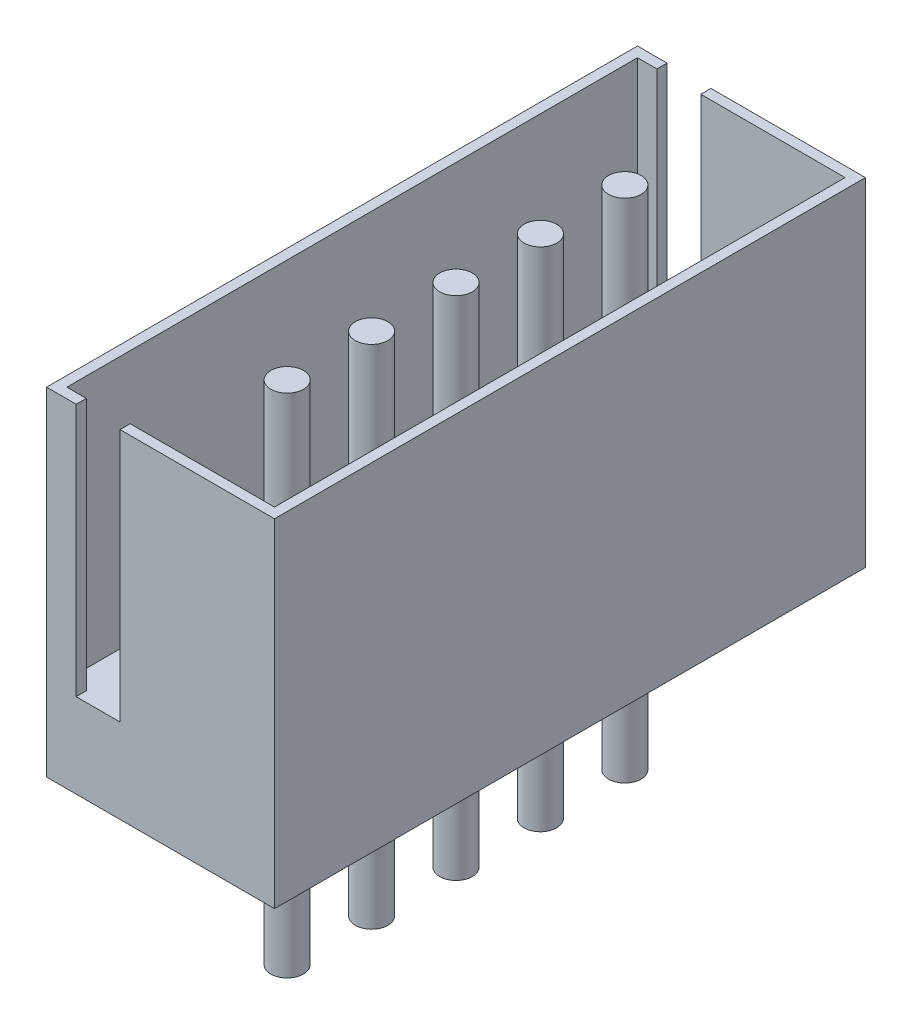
ISO-10303-21;
HEADER;
FILE_DESCRIPTION(('STEP AP214'),'2;1');
FILE_NAME('part.step','',(''),(''),'','','');
FILE_SCHEMA(('AUTOMOTIVE_DESIGN { 1 0 10303 214 1 1 1 1 }'));
ENDSEC;
DATA;
#1=APPLICATION_CONTEXT('core data for automotive mechanical design processes');
#2=APPLICATION_PROTOCOL_DEFINITION('international standard','automotive_design',2000,#1);
#3=PRODUCT_CONTEXT('',#1,'mechanical');
#4=PRODUCT('Part','Part','',(#3));
#5=PRODUCT_RELATED_PRODUCT_CATEGORY('part','',(#4));
#6=PRODUCT_DEFINITION_FORMATION('','',#4);
#7=PRODUCT_DEFINITION_CONTEXT('part definition',#1,'design');
#8=PRODUCT_DEFINITION('design','',#6,#7);
#9=PRODUCT_DEFINITION_SHAPE('','',#8);
#10=(LENGTH_UNIT() NAMED_UNIT(*) SI_UNIT(.MILLI.,.METRE.));
#11=(NAMED_UNIT(*) PLANE_ANGLE_UNIT() SI_UNIT($,.RADIAN.));
#12=(NAMED_UNIT(*) SI_UNIT($,.STERADIAN.) SOLID_ANGLE_UNIT());
#13=UNCERTAINTY_MEASURE_WITH_UNIT(LENGTH_MEASURE(1.E-05),#10,'distance_accuracy_value','');
#14=(GEOMETRIC_REPRESENTATION_CONTEXT(3) GLOBAL_UNCERTAINTY_ASSIGNED_CONTEXT((#13)) GLOBAL_UNIT_ASSIGNED_CONTEXT((#10,
#11,#12)) REPRESENTATION_CONTEXT('',''));
#15=CARTESIAN_POINT('',(0.,0.,0.));
#16=DIRECTION('',(0.,0.,1.));
#17=DIRECTION('',(1.,0.,0.));
#18=AXIS2_PLACEMENT_3D('',#15,#16,#17);
#19=CARTESIAN_POINT('',(9.15044707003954,6.604,-18.4394884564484));
#20=DIRECTION('',(0.,1.,0.));
#21=DIRECTION('',(0.,0.,-1.));
#22=AXIS2_PLACEMENT_3D('',#19,#20,#21);
#23=PLANE('',#22);
#24=CARTESIAN_POINT('',(8.89,6.60399999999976,-22.606));
#25=DIRECTION('',(0.,1.,0.));
#26=DIRECTION('',(0.,0.,1.));
#27=AXIS2_PLACEMENT_3D('',#24,#25,#26);
#28=CIRCLE('',#27,0.245107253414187);
#29=CARTESIAN_POINT('',(8.89,6.60399999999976,-22.3608927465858));
#30=VERTEX_POINT('',#29);
#31=EDGE_CURVE('E20',#30,#30,#28,.T.);
#32=ORIENTED_EDGE('',*,*,#31,.T.);
#33=EDGE_LOOP('',(#32));
#34=FACE_BOUND('',#33,.T.);
#35=ADVANCED_FACE('F16',(#34),#23,.T.);
#36=CARTESIAN_POINT('',(9.15044707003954,6.604,-18.4394884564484));
#37=DIRECTION('',(0.,1.,0.));
#38=DIRECTION('',(0.,0.,-1.));
#39=AXIS2_PLACEMENT_3D('',#36,#37,#38);
#40=PLANE('',#39);
#41=CARTESIAN_POINT('',(8.89,6.60399999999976,-23.876));
#42=DIRECTION('',(0.,1.,0.));
#43=DIRECTION('',(0.,0.,1.));
#44=AXIS2_PLACEMENT_3D('',#41,#42,#43);
#45=CIRCLE('',#44,0.245107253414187);
#46=CARTESIAN_POINT('',(8.89,6.60399999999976,-23.6308927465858));
#47=VERTEX_POINT('',#46);
#48=EDGE_CURVE('E220',#47,#47,#45,.T.);
#49=ORIENTED_EDGE('',*,*,#48,.T.);
#50=EDGE_LOOP('',(#49));
#51=FACE_BOUND('',#50,.T.);
#52=ADVANCED_FACE('F667',(#51),#40,.T.);
#53=CARTESIAN_POINT('',(9.15044707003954,6.604,-18.4394884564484));
#54=DIRECTION('',(0.,1.,0.));
#55=DIRECTION('',(0.,0.,-1.));
#56=AXIS2_PLACEMENT_3D('',#53,#54,#55);
#57=PLANE('',#56);
#58=CARTESIAN_POINT('',(8.89,6.60399999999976,-21.336));
#59=DIRECTION('',(0.,1.,0.));
#60=DIRECTION('',(0.,0.,1.));
#61=AXIS2_PLACEMENT_3D('',#58,#59,#60);
#62=CIRCLE('',#61,0.245107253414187);
#63=CARTESIAN_POINT('',(8.89,6.60399999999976,-21.0908927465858));
#64=VERTEX_POINT('',#63);
#65=EDGE_CURVE('E218',#64,#64,#62,.T.);
#66=ORIENTED_EDGE('',*,*,#65,.T.);
#67=EDGE_LOOP('',(#66));
#68=FACE_BOUND('',#67,.T.);
#69=ADVANCED_FACE('F670',(#68),#57,.T.);
#70=CARTESIAN_POINT('',(9.15044707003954,6.604,-18.4394884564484));
#71=DIRECTION('',(0.,1.,0.));
#72=DIRECTION('',(0.,0.,-1.));
#73=AXIS2_PLACEMENT_3D('',#70,#71,#72);
#74=PLANE('',#73);
#75=CARTESIAN_POINT('',(8.89,6.60399999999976,-20.066));
#76=DIRECTION('',(0.,1.,0.));
#77=DIRECTION('',(0.,0.,1.));
#78=AXIS2_PLACEMENT_3D('',#75,#76,#77);
#79=CIRCLE('',#78,0.24510725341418);
#80=CARTESIAN_POINT('',(8.89,6.60399999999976,-19.8208927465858));
#81=VERTEX_POINT('',#80);
#82=EDGE_CURVE('E215',#81,#81,#79,.T.);
#83=ORIENTED_EDGE('',*,*,#82,.T.);
#84=EDGE_LOOP('',(#83));
#85=FACE_BOUND('',#84,.T.);
#86=ADVANCED_FACE('F673',(#85),#74,.T.);
#87=CARTESIAN_POINT('',(9.15044707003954,6.604,-18.4394884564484));
#88=DIRECTION('',(0.,1.,0.));
#89=DIRECTION('',(0.,0.,-1.));
#90=AXIS2_PLACEMENT_3D('',#87,#88,#89);
#91=PLANE('',#90);
#92=CARTESIAN_POINT('',(8.89,6.60399999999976,-18.796));
#93=DIRECTION('',(0.,1.,0.));
#94=DIRECTION('',(0.,0.,1.));
#95=AXIS2_PLACEMENT_3D('',#92,#93,#94);
#96=CIRCLE('',#95,0.24510725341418);
#97=CARTESIAN_POINT('',(8.89,6.60399999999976,-18.5508927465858));
#98=VERTEX_POINT('',#97);
#99=EDGE_CURVE('E159',#98,#98,#96,.T.);
#100=ORIENTED_EDGE('',*,*,#99,.T.);
#101=EDGE_LOOP('',(#100));
#102=FACE_BOUND('',#101,.T.);
#103=ADVANCED_FACE('F232',(#102),#91,.T.);
#104=CARTESIAN_POINT('',(8.89,2.794,-22.606));
#105=DIRECTION('',(0.,1.,0.));
#106=DIRECTION('',(0.,0.,1.));
#107=AXIS2_PLACEMENT_3D('',#104,#105,#106);
#108=CYLINDRICAL_SURFACE('',#107,0.245107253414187);
#109=ORIENTED_EDGE('',*,*,#31,.F.);
#110=EDGE_LOOP('',(#109));
#111=FACE_BOUND('',#110,.T.);
#112=CARTESIAN_POINT('',(8.89,2.794,-22.606));
#113=DIRECTION('',(0.,1.,0.));
#114=DIRECTION('',(0.,0.,1.));
#115=AXIS2_PLACEMENT_3D('',#112,#113,#114);
#116=CIRCLE('',#115,0.245107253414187);
#117=CARTESIAN_POINT('',(8.89,2.794,-22.3608927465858));
#118=VERTEX_POINT('',#117);
#119=EDGE_CURVE('E210',#118,#118,#116,.F.);
#120=ORIENTED_EDGE('',*,*,#119,.F.);
#121=EDGE_LOOP('',(#120));
#122=FACE_BOUND('',#121,.T.);
#123=ADVANCED_FACE('F228',(#111,#122),#108,.T.);
#124=CARTESIAN_POINT('',(8.89,2.794,-23.876));
#125=DIRECTION('',(0.,1.,0.));
#126=DIRECTION('',(0.,0.,1.));
#127=AXIS2_PLACEMENT_3D('',#124,#125,#126);
#128=CYLINDRICAL_SURFACE('',#127,0.245107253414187);
#129=ORIENTED_EDGE('',*,*,#48,.F.);
#130=EDGE_LOOP('',(#129));
#131=FACE_BOUND('',#130,.T.);
#132=CARTESIAN_POINT('',(8.89,2.794,-23.876));
#133=DIRECTION('',(0.,1.,0.));
#134=DIRECTION('',(0.,0.,1.));
#135=AXIS2_PLACEMENT_3D('',#132,#133,#134);
#136=CIRCLE('',#135,0.245107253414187);
#137=CARTESIAN_POINT('',(8.89,2.794,-23.6308927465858));
#138=VERTEX_POINT('',#137);
#139=EDGE_CURVE('E207',#138,#138,#136,.F.);
#140=ORIENTED_EDGE('',*,*,#139,.F.);
#141=EDGE_LOOP('',(#140));
#142=FACE_BOUND('',#141,.T.);
#143=ADVANCED_FACE('F231',(#131,#142),#128,.T.);
#144=CARTESIAN_POINT('',(8.89,2.794,-21.336));
#145=DIRECTION('',(0.,1.,0.));
#146=DIRECTION('',(0.,0.,1.));
#147=AXIS2_PLACEMENT_3D('',#144,#145,#146);
#148=CYLINDRICAL_SURFACE('',#147,0.245107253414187);
#149=ORIENTED_EDGE('',*,*,#65,.F.);
#150=EDGE_LOOP('',(#149));
#151=FACE_BOUND('',#150,.T.);
#152=CARTESIAN_POINT('',(8.89,2.794,-21.336));
#153=DIRECTION('',(0.,1.,0.));
#154=DIRECTION('',(0.,0.,1.));
#155=AXIS2_PLACEMENT_3D('',#152,#153,#154);
#156=CIRCLE('',#155,0.245107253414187);
#157=CARTESIAN_POINT('',(8.89,2.794,-21.0908927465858));
#158=VERTEX_POINT('',#157);
#159=EDGE_CURVE('E204',#158,#158,#156,.F.);
#160=ORIENTED_EDGE('',*,*,#159,.F.);
#161=EDGE_LOOP('',(#160));
#162=FACE_BOUND('',#161,.T.);
#163=ADVANCED_FACE('F657',(#151,#162),#148,.T.);
#164=CARTESIAN_POINT('',(8.89,2.794,-20.066));
#165=DIRECTION('',(0.,1.,0.));
#166=DIRECTION('',(0.,0.,1.));
#167=AXIS2_PLACEMENT_3D('',#164,#165,#166);
#168=CYLINDRICAL_SURFACE('',#167,0.24510725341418);
#169=ORIENTED_EDGE('',*,*,#82,.F.);
#170=EDGE_LOOP('',(#169));
#171=FACE_BOUND('',#170,.T.);
#172=CARTESIAN_POINT('',(8.89,2.794,-20.066));
#173=DIRECTION('',(0.,1.,0.));
#174=DIRECTION('',(0.,0.,1.));
#175=AXIS2_PLACEMENT_3D('',#172,#173,#174);
#176=CIRCLE('',#175,0.24510725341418);
#177=CARTESIAN_POINT('',(8.89,2.794,-19.8208927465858));
#178=VERTEX_POINT('',#177);
#179=EDGE_CURVE('E201',#178,#178,#176,.F.);
#180=ORIENTED_EDGE('',*,*,#179,.F.);
#181=EDGE_LOOP('',(#180));
#182=FACE_BOUND('',#181,.T.);
#183=ADVANCED_FACE('F653',(#171,#182),#168,.T.);
#184=CARTESIAN_POINT('',(8.89,2.794,-18.796));
#185=DIRECTION('',(0.,1.,0.));
#186=DIRECTION('',(0.,0.,1.));
#187=AXIS2_PLACEMENT_3D('',#184,#185,#186);
#188=CYLINDRICAL_SURFACE('',#187,0.24510725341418);
#189=ORIENTED_EDGE('',*,*,#99,.F.);
#190=EDGE_LOOP('',(#189));
#191=FACE_BOUND('',#190,.T.);
#192=CARTESIAN_POINT('',(8.89,2.794,-18.796));
#193=DIRECTION('',(0.,1.,0.));
#194=DIRECTION('',(0.,0.,1.));
#195=AXIS2_PLACEMENT_3D('',#192,#193,#194);
#196=CIRCLE('',#195,0.24510725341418);
#197=CARTESIAN_POINT('',(8.89,2.794,-18.5508927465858));
#198=VERTEX_POINT('',#197);
#199=EDGE_CURVE('E197',#198,#198,#196,.F.);
#200=ORIENTED_EDGE('',*,*,#199,.F.);
#201=EDGE_LOOP('',(#200));
#202=FACE_BOUND('',#201,.T.);
#203=ADVANCED_FACE('F649',(#191,#202),#188,.T.);
#204=CARTESIAN_POINT('',(9.15044707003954,-1.016,-18.4394884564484));
#205=DIRECTION('',(0.,1.,0.));
#206=DIRECTION('',(0.,0.,-1.));
#207=AXIS2_PLACEMENT_3D('',#204,#205,#206);
#208=PLANE('',#207);
#209=CARTESIAN_POINT('',(8.89,-1.01599999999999,-22.606));
#210=DIRECTION('',(0.,1.,0.));
#211=DIRECTION('',(0.,0.,1.));
#212=AXIS2_PLACEMENT_3D('',#209,#210,#211);
#213=CIRCLE('',#212,0.245107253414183);
#214=CARTESIAN_POINT('',(8.89,-1.01599999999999,-22.3608927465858));
#215=VERTEX_POINT('',#214);
#216=EDGE_CURVE('E193',#215,#215,#213,.F.);
#217=ORIENTED_EDGE('',*,*,#216,.T.);
#218=EDGE_LOOP('',(#217));
#219=FACE_BOUND('',#218,.T.);
#220=ADVANCED_FACE('F652',(#219),#208,.F.);
#221=CARTESIAN_POINT('',(9.15044707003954,-1.016,-18.4394884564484));
#222=DIRECTION('',(0.,1.,0.));
#223=DIRECTION('',(0.,0.,-1.));
#224=AXIS2_PLACEMENT_3D('',#221,#222,#223);
#225=PLANE('',#224);
#226=CARTESIAN_POINT('',(8.89,-1.01599999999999,-23.876));
#227=DIRECTION('',(0.,1.,0.));
#228=DIRECTION('',(0.,0.,1.));
#229=AXIS2_PLACEMENT_3D('',#226,#227,#228);
#230=CIRCLE('',#229,0.245107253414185);
#231=CARTESIAN_POINT('',(8.89,-1.01599999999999,-23.6308927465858));
#232=VERTEX_POINT('',#231);
#233=EDGE_CURVE('E190',#232,#232,#230,.F.);
#234=ORIENTED_EDGE('',*,*,#233,.T.);
#235=EDGE_LOOP('',(#234));
#236=FACE_BOUND('',#235,.T.);
#237=ADVANCED_FACE('F683',(#236),#225,.F.);
#238=CARTESIAN_POINT('',(9.15044707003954,-1.016,-18.4394884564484));
#239=DIRECTION('',(0.,1.,0.));
#240=DIRECTION('',(0.,0.,-1.));
#241=AXIS2_PLACEMENT_3D('',#238,#239,#240);
#242=PLANE('',#241);
#243=CARTESIAN_POINT('',(8.89,-1.01599999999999,-21.336));
#244=DIRECTION('',(0.,1.,0.));
#245=DIRECTION('',(0.,0.,1.));
#246=AXIS2_PLACEMENT_3D('',#243,#244,#245);
#247=CIRCLE('',#246,0.245107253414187);
#248=CARTESIAN_POINT('',(8.89,-1.01599999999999,-21.0908927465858));
#249=VERTEX_POINT('',#248);
#250=EDGE_CURVE('E187',#249,#249,#247,.F.);
#251=ORIENTED_EDGE('',*,*,#250,.T.);
#252=EDGE_LOOP('',(#251));
#253=FACE_BOUND('',#252,.T.);
#254=ADVANCED_FACE('F687',(#253),#242,.F.);
#255=CARTESIAN_POINT('',(9.15044707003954,-1.016,-18.4394884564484));
#256=DIRECTION('',(0.,1.,0.));
#257=DIRECTION('',(0.,0.,-1.));
#258=AXIS2_PLACEMENT_3D('',#255,#256,#257);
#259=PLANE('',#258);
#260=CARTESIAN_POINT('',(8.89,-1.01599999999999,-20.066));
#261=DIRECTION('',(0.,1.,0.));
#262=DIRECTION('',(0.,0.,1.));
#263=AXIS2_PLACEMENT_3D('',#260,#261,#262);
#264=CIRCLE('',#263,0.24510725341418);
#265=CARTESIAN_POINT('',(8.89,-1.01599999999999,-19.8208927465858));
#266=VERTEX_POINT('',#265);
#267=EDGE_CURVE('E184',#266,#266,#264,.F.);
#268=ORIENTED_EDGE('',*,*,#267,.T.);
#269=EDGE_LOOP('',(#268));
#270=FACE_BOUND('',#269,.T.);
#271=ADVANCED_FACE('F249',(#270),#259,.F.);
#272=CARTESIAN_POINT('',(9.15044707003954,-1.016,-18.4394884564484));
#273=DIRECTION('',(0.,1.,0.));
#274=DIRECTION('',(0.,0.,-1.));
#275=AXIS2_PLACEMENT_3D('',#272,#273,#274);
#276=PLANE('',#275);
#277=CARTESIAN_POINT('',(8.89,-1.01599999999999,-18.796));
#278=DIRECTION('',(0.,1.,0.));
#279=DIRECTION('',(0.,0.,1.));
#280=AXIS2_PLACEMENT_3D('',#277,#278,#279);
#281=CIRCLE('',#280,0.245107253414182);
#282=CARTESIAN_POINT('',(8.89,-1.01599999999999,-18.5508927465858));
#283=VERTEX_POINT('',#282);
#284=EDGE_CURVE('E180',#283,#283,#281,.F.);
#285=ORIENTED_EDGE('',*,*,#284,.T.);
#286=EDGE_LOOP('',(#285));
#287=FACE_BOUND('',#286,.T.);
#288=ADVANCED_FACE('F238',(#287),#276,.F.);
#289=CARTESIAN_POINT('',(10.514584,2.794,-16.7132));
#290=DIRECTION('',(0.,1.,0.));
#291=DIRECTION('',(0.,0.,-1.));
#292=AXIS2_PLACEMENT_3D('',#289,#290,#291);
#293=PLANE('',#292);
#294=ORIENTED_EDGE('',*,*,#199,.T.);
#295=EDGE_LOOP('',(#294));
#296=FACE_BOUND('',#295,.T.);
#297=ORIENTED_EDGE('',*,*,#179,.T.);
#298=EDGE_LOOP('',(#297));
#299=FACE_BOUND('',#298,.T.);
#300=ORIENTED_EDGE('',*,*,#159,.T.);
#301=EDGE_LOOP('',(#300));
#302=FACE_BOUND('',#301,.T.);
#303=ORIENTED_EDGE('',*,*,#139,.T.);
#304=EDGE_LOOP('',(#303));
#305=FACE_BOUND('',#304,.T.);
#306=ORIENTED_EDGE('',*,*,#119,.T.);
#307=EDGE_LOOP('',(#306));
#308=FACE_BOUND('',#307,.T.);
#309=DIRECTION('',(1.,0.,0.));
#310=VECTOR('',#309,1.);
#311=CARTESIAN_POINT('',(7.47395,2.794,-17.0434));
#312=LINE('',#311,#310);
#313=CARTESIAN_POINT('',(7.32790000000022,2.794,-17.0434));
#314=VERTEX_POINT('',#313);
#315=CARTESIAN_POINT('',(7.61999999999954,2.794,-17.0433999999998));
#316=VERTEX_POINT('',#315);
#317=EDGE_CURVE('E350',#314,#316,#312,.T.);
#318=ORIENTED_EDGE('',*,*,#317,.T.);
#319=DIRECTION('',(0.,0.,1.));
#320=VECTOR('',#319,1.);
#321=CARTESIAN_POINT('',(7.62,2.794,-16.9672));
#322=LINE('',#321,#320);
#323=CARTESIAN_POINT('',(7.62,2.794,-16.8910000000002));
#324=VERTEX_POINT('',#323);
#325=EDGE_CURVE('E331',#316,#324,#322,.T.);
#326=ORIENTED_EDGE('',*,*,#325,.T.);
#327=DIRECTION('',(1.,0.,0.));
#328=VECTOR('',#327,1.);
#329=CARTESIAN_POINT('',(8.89,2.794,-16.891));
#330=LINE('',#329,#328);
#331=CARTESIAN_POINT('',(8.2804,2.794,-16.8910000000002));
#332=VERTEX_POINT('',#331);
#333=EDGE_CURVE('E157',#324,#332,#330,.T.);
#334=ORIENTED_EDGE('',*,*,#333,.T.);
#335=DIRECTION('',(0.,0.,-1.));
#336=VECTOR('',#335,1.);
#337=CARTESIAN_POINT('',(8.2804,2.794,-16.9672));
#338=LINE('',#337,#336);
#339=CARTESIAN_POINT('',(8.2804,2.794,-17.0433999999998));
#340=VERTEX_POINT('',#339);
#341=EDGE_CURVE('E329',#332,#340,#338,.T.);
#342=ORIENTED_EDGE('',*,*,#341,.T.);
#343=DIRECTION('',(1.,0.,0.));
#344=VECTOR('',#343,1.);
#345=CARTESIAN_POINT('',(9.36625,2.794,-17.0434));
#346=LINE('',#345,#344);
#347=CARTESIAN_POINT('',(10.4521,2.794,-17.0434));
#348=VERTEX_POINT('',#347);
#349=EDGE_CURVE('E343',#340,#348,#346,.T.);
#350=ORIENTED_EDGE('',*,*,#349,.T.);
#351=DIRECTION('',(0.,0.,-1.));
#352=VECTOR('',#351,1.);
#353=CARTESIAN_POINT('',(10.4521,2.794,-21.336));
#354=LINE('',#353,#352);
#355=CARTESIAN_POINT('',(10.4521,2.794,-25.6286));
#356=VERTEX_POINT('',#355);
#357=EDGE_CURVE('E347',#348,#356,#354,.T.);
#358=ORIENTED_EDGE('',*,*,#357,.T.);
#359=DIRECTION('',(-1.,0.,0.));
#360=VECTOR('',#359,1.);
#361=CARTESIAN_POINT('',(9.36625,2.794,-25.6286));
#362=LINE('',#361,#360);
#363=CARTESIAN_POINT('',(8.2804,2.794,-25.6285999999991));
#364=VERTEX_POINT('',#363);
#365=EDGE_CURVE('E155',#356,#364,#362,.T.);
#366=ORIENTED_EDGE('',*,*,#365,.T.);
#367=DIRECTION('',(0.,0.,-1.));
#368=VECTOR('',#367,1.);
#369=CARTESIAN_POINT('',(8.2804,2.794,-21.336));
#370=LINE('',#369,#368);
#371=CARTESIAN_POINT('',(8.2804,2.794,-25.7810000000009));
#372=VERTEX_POINT('',#371);
#373=EDGE_CURVE('E141',#364,#372,#370,.T.);
#374=ORIENTED_EDGE('',*,*,#373,.T.);
#375=DIRECTION('',(-1.,0.,0.));
#376=VECTOR('',#375,1.);
#377=CARTESIAN_POINT('',(8.89,2.794,-25.781));
#378=LINE('',#377,#376);
#379=CARTESIAN_POINT('',(7.62,2.794,-25.7810000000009));
#380=VERTEX_POINT('',#379);
#381=EDGE_CURVE('E133',#372,#380,#378,.T.);
#382=ORIENTED_EDGE('',*,*,#381,.T.);
#383=DIRECTION('',(0.,0.,1.));
#384=VECTOR('',#383,1.);
#385=CARTESIAN_POINT('',(7.62,2.794,-21.336));
#386=LINE('',#385,#384);
#387=CARTESIAN_POINT('',(7.61999999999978,2.794,-25.6285999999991));
#388=VERTEX_POINT('',#387);
#389=EDGE_CURVE('E127',#380,#388,#386,.T.);
#390=ORIENTED_EDGE('',*,*,#389,.T.);
#391=DIRECTION('',(-1.,0.,0.));
#392=VECTOR('',#391,1.);
#393=CARTESIAN_POINT('',(7.47395,2.794,-25.6286));
#394=LINE('',#393,#392);
#395=CARTESIAN_POINT('',(7.32790000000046,2.794,-25.6286));
#396=VERTEX_POINT('',#395);
#397=EDGE_CURVE('E196',#388,#396,#394,.T.);
#398=ORIENTED_EDGE('',*,*,#397,.T.);
#399=DIRECTION('',(0.,0.,1.));
#400=VECTOR('',#399,1.);
#401=CARTESIAN_POINT('',(7.3279,2.794,-21.336));
#402=LINE('',#401,#400);
#403=EDGE_CURVE('E322',#396,#314,#402,.T.);
#404=ORIENTED_EDGE('',*,*,#403,.T.);
#405=EDGE_LOOP('',(#318,#326,#334,#342,#350,#358,#366,#374,#382,#390,#398,#404));
#406=FACE_BOUND('',#405,.T.);
#407=ADVANCED_FACE('F153',(#296,#299,#302,#305,#308,#406),#293,.T.);
#408=CARTESIAN_POINT('',(7.31325928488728,2.7178,-17.0434));
#409=DIRECTION('',(0.,0.,1.));
#410=DIRECTION('',(1.,0.,0.));
#411=AXIS2_PLACEMENT_3D('',#408,#409,#410);
#412=PLANE('',#411);
#413=ORIENTED_EDGE('',*,*,#317,.F.);
#414=DIRECTION('',(0.,1.,0.));
#415=VECTOR('',#414,1.);
#416=CARTESIAN_POINT('',(7.3279,4.699,-17.0434));
#417=LINE('',#416,#415);
#418=CARTESIAN_POINT('',(7.32790000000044,6.604,-17.0434));
#419=VERTEX_POINT('',#418);
#420=EDGE_CURVE('E319',#314,#419,#417,.T.);
#421=ORIENTED_EDGE('',*,*,#420,.T.);
#422=DIRECTION('',(-1.,0.,0.));
#423=VECTOR('',#422,1.);
#424=CARTESIAN_POINT('',(7.47395,6.604,-17.0434));
#425=LINE('',#424,#423);
#426=CARTESIAN_POINT('',(7.61999999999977,6.604,-17.0433999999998));
#427=VERTEX_POINT('',#426);
#428=EDGE_CURVE('E200',#427,#419,#425,.T.);
#429=ORIENTED_EDGE('',*,*,#428,.F.);
#430=DIRECTION('',(0.,-1.,0.));
#431=VECTOR('',#430,1.);
#432=CARTESIAN_POINT('',(7.62,4.699,-17.0433999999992));
#433=LINE('',#432,#431);
#434=EDGE_CURVE('E334',#427,#316,#433,.T.);
#435=ORIENTED_EDGE('',*,*,#434,.T.);
#436=EDGE_LOOP('',(#413,#421,#429,#435));
#437=FACE_BOUND('',#436,.T.);
#438=ADVANCED_FACE('F237',(#437),#412,.F.);
#439=CARTESIAN_POINT('',(10.495534,2.7178,-25.6286));
#440=DIRECTION('',(0.,0.,-1.));
#441=DIRECTION('',(-1.,0.,0.));
#442=AXIS2_PLACEMENT_3D('',#439,#440,#441);
#443=PLANE('',#442);
#444=ORIENTED_EDGE('',*,*,#365,.F.);
#445=DIRECTION('',(0.,1.,0.));
#446=VECTOR('',#445,1.);
#447=CARTESIAN_POINT('',(10.4521,4.699,-25.6286));
#448=LINE('',#447,#446);
#449=CARTESIAN_POINT('',(10.4521,6.604,-25.6286));
#450=VERTEX_POINT('',#449);
#451=EDGE_CURVE('E345',#356,#450,#448,.T.);
#452=ORIENTED_EDGE('',*,*,#451,.T.);
#453=DIRECTION('',(1.,0.,0.));
#454=VECTOR('',#453,1.);
#455=CARTESIAN_POINT('',(8.89,6.604,-25.6286));
#456=LINE('',#455,#454);
#457=CARTESIAN_POINT('',(8.2804,6.604,-25.6285999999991));
#458=VERTEX_POINT('',#457);
#459=EDGE_CURVE('E314',#458,#450,#456,.T.);
#460=ORIENTED_EDGE('',*,*,#459,.F.);
#461=DIRECTION('',(0.,-1.,0.));
#462=VECTOR('',#461,1.);
#463=CARTESIAN_POINT('',(8.2804,4.699,-25.6285999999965));
#464=LINE('',#463,#462);
#465=EDGE_CURVE('E317',#458,#364,#464,.T.);
#466=ORIENTED_EDGE('',*,*,#465,.T.);
#467=EDGE_LOOP('',(#444,#452,#460,#466));
#468=FACE_BOUND('',#467,.T.);
#469=ADVANCED_FACE('F246',(#468),#443,.F.);
#470=CARTESIAN_POINT('',(10.4521,2.7178,-16.871696));
#471=DIRECTION('',(1.,0.,0.));
#472=DIRECTION('',(0.,0.,-1.));
#473=AXIS2_PLACEMENT_3D('',#470,#471,#472);
#474=PLANE('',#473);
#475=ORIENTED_EDGE('',*,*,#357,.F.);
#476=DIRECTION('',(0.,1.,0.));
#477=VECTOR('',#476,1.);
#478=CARTESIAN_POINT('',(10.4521,4.699,-17.0434));
#479=LINE('',#478,#477);
#480=CARTESIAN_POINT('',(10.4521,6.604,-17.0434));
#481=VERTEX_POINT('',#480);
#482=EDGE_CURVE('E341',#348,#481,#479,.T.);
#483=ORIENTED_EDGE('',*,*,#482,.T.);
#484=DIRECTION('',(0.,0.,1.));
#485=VECTOR('',#484,1.);
#486=CARTESIAN_POINT('',(10.4521,6.604,-21.336));
#487=LINE('',#486,#485);
#488=EDGE_CURVE('E311',#450,#481,#487,.T.);
#489=ORIENTED_EDGE('',*,*,#488,.F.);
#490=ORIENTED_EDGE('',*,*,#451,.F.);
#491=EDGE_LOOP('',(#475,#483,#489,#490));
#492=FACE_BOUND('',#491,.T.);
#493=ADVANCED_FACE('F392',(#492),#474,.F.);
#494=CARTESIAN_POINT('',(8.236966,2.7178,-17.0434));
#495=DIRECTION('',(0.,0.,1.));
#496=DIRECTION('',(1.,0.,0.));
#497=AXIS2_PLACEMENT_3D('',#494,#495,#496);
#498=PLANE('',#497);
#499=ORIENTED_EDGE('',*,*,#349,.F.);
#500=DIRECTION('',(0.,1.,0.));
#501=VECTOR('',#500,1.);
#502=CARTESIAN_POINT('',(8.2804,4.699,-17.0433999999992));
#503=LINE('',#502,#501);
#504=CARTESIAN_POINT('',(8.2804,6.604,-17.0433999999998));
#505=VERTEX_POINT('',#504);
#506=EDGE_CURVE('E327',#340,#505,#503,.T.);
#507=ORIENTED_EDGE('',*,*,#506,.T.);
#508=DIRECTION('',(-1.,0.,0.));
#509=VECTOR('',#508,1.);
#510=CARTESIAN_POINT('',(8.89,6.604,-17.0434));
#511=LINE('',#510,#509);
#512=EDGE_CURVE('E308',#481,#505,#511,.T.);
#513=ORIENTED_EDGE('',*,*,#512,.F.);
#514=ORIENTED_EDGE('',*,*,#482,.F.);
#515=EDGE_LOOP('',(#499,#507,#513,#514));
#516=FACE_BOUND('',#515,.T.);
#517=ADVANCED_FACE('F388',(#516),#498,.F.);
#518=CARTESIAN_POINT('',(7.63464071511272,2.7178,-25.6286));
#519=DIRECTION('',(0.,0.,-1.));
#520=DIRECTION('',(-1.,0.,0.));
#521=AXIS2_PLACEMENT_3D('',#518,#519,#520);
#522=PLANE('',#521);
#523=ORIENTED_EDGE('',*,*,#397,.F.);
#524=DIRECTION('',(0.,1.,0.));
#525=VECTOR('',#524,1.);
#526=CARTESIAN_POINT('',(7.62,4.699,-25.6285999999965));
#527=LINE('',#526,#525);
#528=CARTESIAN_POINT('',(7.61999999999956,6.604,-25.6285999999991));
#529=VERTEX_POINT('',#528);
#530=EDGE_CURVE('E300',#388,#529,#527,.T.);
#531=ORIENTED_EDGE('',*,*,#530,.T.);
#532=DIRECTION('',(1.,0.,0.));
#533=VECTOR('',#532,1.);
#534=CARTESIAN_POINT('',(7.47395,6.604,-25.6286));
#535=LINE('',#534,#533);
#536=CARTESIAN_POINT('',(7.32790000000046,6.604,-25.6286));
#537=VERTEX_POINT('',#536);
#538=EDGE_CURVE('E339',#537,#529,#535,.T.);
#539=ORIENTED_EDGE('',*,*,#538,.F.);
#540=DIRECTION('',(0.,-1.,0.));
#541=VECTOR('',#540,1.);
#542=CARTESIAN_POINT('',(7.3279,4.699,-25.6286));
#543=LINE('',#542,#541);
#544=EDGE_CURVE('E324',#537,#396,#543,.T.);
#545=ORIENTED_EDGE('',*,*,#544,.T.);
#546=EDGE_LOOP('',(#523,#531,#539,#545));
#547=FACE_BOUND('',#546,.T.);
#548=ADVANCED_FACE('F354',(#547),#522,.F.);
#549=CARTESIAN_POINT('',(8.89,-1.01599999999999,-22.606));
#550=DIRECTION('',(0.,1.,0.));
#551=DIRECTION('',(0.,0.,1.));
#552=AXIS2_PLACEMENT_3D('',#549,#550,#551);
#553=CYLINDRICAL_SURFACE('',#552,0.245107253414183);
#554=ORIENTED_EDGE('',*,*,#216,.F.);
#555=EDGE_LOOP('',(#554));
#556=FACE_BOUND('',#555,.T.);
#557=CARTESIAN_POINT('',(8.89,1.52400000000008,-22.606));
#558=DIRECTION('',(0.,1.,0.));
#559=DIRECTION('',(0.,0.,1.));
#560=AXIS2_PLACEMENT_3D('',#557,#558,#559);
#561=CIRCLE('',#560,0.245107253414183);
#562=CARTESIAN_POINT('',(8.89,1.52400000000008,-22.3608927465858));
#563=VERTEX_POINT('',#562);
#564=EDGE_CURVE('E176',#563,#563,#561,.F.);
#565=ORIENTED_EDGE('',*,*,#564,.T.);
#566=EDGE_LOOP('',(#565));
#567=FACE_BOUND('',#566,.T.);
#568=ADVANCED_FACE('F486',(#556,#567),#553,.T.);
#569=CARTESIAN_POINT('',(8.89,-1.01599999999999,-23.876));
#570=DIRECTION('',(0.,1.,0.));
#571=DIRECTION('',(0.,0.,1.));
#572=AXIS2_PLACEMENT_3D('',#569,#570,#571);
#573=CYLINDRICAL_SURFACE('',#572,0.245107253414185);
#574=ORIENTED_EDGE('',*,*,#233,.F.);
#575=EDGE_LOOP('',(#574));
#576=FACE_BOUND('',#575,.T.);
#577=CARTESIAN_POINT('',(8.89,1.52400000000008,-23.876));
#578=DIRECTION('',(0.,1.,0.));
#579=DIRECTION('',(0.,0.,1.));
#580=AXIS2_PLACEMENT_3D('',#577,#578,#579);
#581=CIRCLE('',#580,0.245107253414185);
#582=CARTESIAN_POINT('',(8.89,1.52400000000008,-23.6308927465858));
#583=VERTEX_POINT('',#582);
#584=EDGE_CURVE('E173',#583,#583,#581,.F.);
#585=ORIENTED_EDGE('',*,*,#584,.T.);
#586=EDGE_LOOP('',(#585));
#587=FACE_BOUND('',#586,.T.);
#588=ADVANCED_FACE('F497',(#576,#587),#573,.T.);
#589=CARTESIAN_POINT('',(8.89,-1.01599999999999,-21.336));
#590=DIRECTION('',(0.,1.,0.));
#591=DIRECTION('',(0.,0.,1.));
#592=AXIS2_PLACEMENT_3D('',#589,#590,#591);
#593=CYLINDRICAL_SURFACE('',#592,0.245107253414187);
#594=ORIENTED_EDGE('',*,*,#250,.F.);
#595=EDGE_LOOP('',(#594));
#596=FACE_BOUND('',#595,.T.);
#597=CARTESIAN_POINT('',(8.89,1.52400000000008,-21.336));
#598=DIRECTION('',(0.,1.,0.));
#599=DIRECTION('',(0.,0.,1.));
#600=AXIS2_PLACEMENT_3D('',#597,#598,#599);
#601=CIRCLE('',#600,0.245107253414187);
#602=CARTESIAN_POINT('',(8.89,1.52400000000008,-21.0908927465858));
#603=VERTEX_POINT('',#602);
#604=EDGE_CURVE('E170',#603,#603,#601,.F.);
#605=ORIENTED_EDGE('',*,*,#604,.T.);
#606=EDGE_LOOP('',(#605));
#607=FACE_BOUND('',#606,.T.);
#608=ADVANCED_FACE('F509',(#596,#607),#593,.T.);
#609=CARTESIAN_POINT('',(8.89,-1.01599999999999,-20.066));
#610=DIRECTION('',(0.,1.,0.));
#611=DIRECTION('',(0.,0.,1.));
#612=AXIS2_PLACEMENT_3D('',#609,#610,#611);
#613=CYLINDRICAL_SURFACE('',#612,0.24510725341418);
#614=ORIENTED_EDGE('',*,*,#267,.F.);
#615=EDGE_LOOP('',(#614));
#616=FACE_BOUND('',#615,.T.);
#617=CARTESIAN_POINT('',(8.89,1.52400000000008,-20.066));
#618=DIRECTION('',(0.,1.,0.));
#619=DIRECTION('',(0.,0.,1.));
#620=AXIS2_PLACEMENT_3D('',#617,#618,#619);
#621=CIRCLE('',#620,0.24510725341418);
#622=CARTESIAN_POINT('',(8.89,1.52400000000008,-19.8208927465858));
#623=VERTEX_POINT('',#622);
#624=EDGE_CURVE('E167',#623,#623,#621,.F.);
#625=ORIENTED_EDGE('',*,*,#624,.T.);
#626=EDGE_LOOP('',(#625));
#627=FACE_BOUND('',#626,.T.);
#628=ADVANCED_FACE('F520',(#616,#627),#613,.T.);
#629=CARTESIAN_POINT('',(8.89,-1.01599999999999,-18.796));
#630=DIRECTION('',(0.,1.,0.));
#631=DIRECTION('',(0.,0.,1.));
#632=AXIS2_PLACEMENT_3D('',#629,#630,#631);
#633=CYLINDRICAL_SURFACE('',#632,0.245107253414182);
#634=ORIENTED_EDGE('',*,*,#284,.F.);
#635=EDGE_LOOP('',(#634));
#636=FACE_BOUND('',#635,.T.);
#637=CARTESIAN_POINT('',(8.89,1.52400000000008,-18.796));
#638=DIRECTION('',(0.,1.,0.));
#639=DIRECTION('',(0.,0.,1.));
#640=AXIS2_PLACEMENT_3D('',#637,#638,#639);
#641=CIRCLE('',#640,0.245107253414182);
#642=CARTESIAN_POINT('',(8.89,1.52400000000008,-18.5508927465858));
#643=VERTEX_POINT('',#642);
#644=EDGE_CURVE('E163',#643,#643,#641,.F.);
#645=ORIENTED_EDGE('',*,*,#644,.T.);
#646=EDGE_LOOP('',(#645));
#647=FACE_BOUND('',#646,.T.);
#648=ADVANCED_FACE('F531',(#636,#647),#633,.T.);
#649=CARTESIAN_POINT('',(7.62,2.7178,-17.0580407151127));
#650=DIRECTION('',(-1.,0.,0.));
#651=DIRECTION('',(0.,0.,1.));
#652=AXIS2_PLACEMENT_3D('',#649,#650,#651);
#653=PLANE('',#652);
#654=ORIENTED_EDGE('',*,*,#325,.F.);
#655=ORIENTED_EDGE('',*,*,#434,.F.);
#656=DIRECTION('',(0.,0.,-1.));
#657=VECTOR('',#656,1.);
#658=CARTESIAN_POINT('',(7.62,6.604,-16.9672));
#659=LINE('',#658,#657);
#660=CARTESIAN_POINT('',(7.62,6.604,-16.8910000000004));
#661=VERTEX_POINT('',#660);
#662=EDGE_CURVE('E183',#661,#427,#659,.T.);
#663=ORIENTED_EDGE('',*,*,#662,.F.);
#664=DIRECTION('',(0.,1.,0.));
#665=VECTOR('',#664,1.);
#666=CARTESIAN_POINT('',(7.62,4.064,-16.891));
#667=LINE('',#666,#665);
#668=EDGE_CURVE('E166',#324,#661,#667,.T.);
#669=ORIENTED_EDGE('',*,*,#668,.F.);
#670=EDGE_LOOP('',(#654,#655,#663,#669));
#671=FACE_BOUND('',#670,.T.);
#672=ADVANCED_FACE('F369',(#671),#653,.F.);
#673=CARTESIAN_POINT('',(8.2804,2.7178,-16.8763592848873));
#674=DIRECTION('',(1.,0.,0.));
#675=DIRECTION('',(0.,0.,-1.));
#676=AXIS2_PLACEMENT_3D('',#673,#674,#675);
#677=PLANE('',#676);
#678=ORIENTED_EDGE('',*,*,#341,.F.);
#679=DIRECTION('',(0.,-1.,0.));
#680=VECTOR('',#679,1.);
#681=CARTESIAN_POINT('',(8.2804,4.064,-16.891));
#682=LINE('',#681,#680);
#683=CARTESIAN_POINT('',(8.2804,6.604,-16.8910000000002));
#684=VERTEX_POINT('',#683);
#685=EDGE_CURVE('E285',#684,#332,#682,.T.);
#686=ORIENTED_EDGE('',*,*,#685,.F.);
#687=DIRECTION('',(0.,0.,1.));
#688=VECTOR('',#687,1.);
#689=CARTESIAN_POINT('',(8.2804,6.604,-21.336));
#690=LINE('',#689,#688);
#691=EDGE_CURVE('E306',#505,#684,#690,.T.);
#692=ORIENTED_EDGE('',*,*,#691,.F.);
#693=ORIENTED_EDGE('',*,*,#506,.F.);
#694=EDGE_LOOP('',(#678,#686,#692,#693));
#695=FACE_BOUND('',#694,.T.);
#696=ADVANCED_FACE('F376',(#695),#677,.F.);
#697=CARTESIAN_POINT('',(7.3279,2.7178,-25.800304));
#698=DIRECTION('',(-1.,0.,0.));
#699=DIRECTION('',(0.,0.,1.));
#700=AXIS2_PLACEMENT_3D('',#697,#698,#699);
#701=PLANE('',#700);
#702=ORIENTED_EDGE('',*,*,#403,.F.);
#703=ORIENTED_EDGE('',*,*,#544,.F.);
#704=DIRECTION('',(0.,0.,-1.));
#705=VECTOR('',#704,1.);
#706=CARTESIAN_POINT('',(7.3279,6.604,-21.336));
#707=LINE('',#706,#705);
#708=EDGE_CURVE('E282',#419,#537,#707,.T.);
#709=ORIENTED_EDGE('',*,*,#708,.F.);
#710=ORIENTED_EDGE('',*,*,#420,.F.);
#711=EDGE_LOOP('',(#702,#703,#709,#710));
#712=FACE_BOUND('',#711,.T.);
#713=ADVANCED_FACE('F361',(#712),#701,.F.);
#714=CARTESIAN_POINT('',(8.2804,2.7178,-25.6139592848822));
#715=DIRECTION('',(1.,0.,0.));
#716=DIRECTION('',(0.,0.,-1.));
#717=AXIS2_PLACEMENT_3D('',#714,#715,#716);
#718=PLANE('',#717);
#719=ORIENTED_EDGE('',*,*,#373,.F.);
#720=ORIENTED_EDGE('',*,*,#465,.F.);
#721=DIRECTION('',(0.,0.,1.));
#722=VECTOR('',#721,1.);
#723=CARTESIAN_POINT('',(8.2804,6.604,-21.336));
#724=LINE('',#723,#722);
#725=CARTESIAN_POINT('',(8.2804,6.604,-25.7810000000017));
#726=VERTEX_POINT('',#725);
#727=EDGE_CURVE('E148',#726,#458,#724,.T.);
#728=ORIENTED_EDGE('',*,*,#727,.F.);
#729=DIRECTION('',(0.,1.,0.));
#730=VECTOR('',#729,1.);
#731=CARTESIAN_POINT('',(8.2804,4.064,-25.781));
#732=LINE('',#731,#730);
#733=EDGE_CURVE('E137',#372,#726,#732,.T.);
#734=ORIENTED_EDGE('',*,*,#733,.F.);
#735=EDGE_LOOP('',(#719,#720,#728,#734));
#736=FACE_BOUND('',#735,.T.);
#737=ADVANCED_FACE('F144',(#736),#718,.F.);
#738=CARTESIAN_POINT('',(10.67308,6.604,-16.7132));
#739=DIRECTION('',(0.,1.,0.));
#740=DIRECTION('',(0.,0.,-1.));
#741=AXIS2_PLACEMENT_3D('',#738,#739,#740);
#742=PLANE('',#741);
#743=DIRECTION('',(1.,0.,0.));
#744=VECTOR('',#743,1.);
#745=CARTESIAN_POINT('',(8.89,6.604,-25.781));
#746=LINE('',#745,#744);
#747=CARTESIAN_POINT('',(10.6045,6.604,-25.781));
#748=VERTEX_POINT('',#747);
#749=EDGE_CURVE('E150',#726,#748,#746,.T.);
#750=ORIENTED_EDGE('',*,*,#749,.F.);
#751=ORIENTED_EDGE('',*,*,#727,.T.);
#752=ORIENTED_EDGE('',*,*,#459,.T.);
#753=ORIENTED_EDGE('',*,*,#488,.T.);
#754=ORIENTED_EDGE('',*,*,#512,.T.);
#755=ORIENTED_EDGE('',*,*,#691,.T.);
#756=DIRECTION('',(-1.,0.,0.));
#757=VECTOR('',#756,1.);
#758=CARTESIAN_POINT('',(8.89,6.604,-16.891));
#759=LINE('',#758,#757);
#760=CARTESIAN_POINT('',(10.6045,6.604,-16.891));
#761=VERTEX_POINT('',#760);
#762=EDGE_CURVE('E288',#761,#684,#759,.T.);
#763=ORIENTED_EDGE('',*,*,#762,.F.);
#764=DIRECTION('',(0.,0.,1.));
#765=VECTOR('',#764,1.);
#766=CARTESIAN_POINT('',(10.6045,6.604,-21.336));
#767=LINE('',#766,#765);
#768=EDGE_CURVE('E303',#748,#761,#767,.T.);
#769=ORIENTED_EDGE('',*,*,#768,.F.);
#770=EDGE_LOOP('',(#750,#751,#752,#753,#754,#755,#763,#769));
#771=FACE_BOUND('',#770,.T.);
#772=ADVANCED_FACE('F382',(#771),#742,.T.);
#773=CARTESIAN_POINT('',(10.6045,1.4224,-16.7132));
#774=DIRECTION('',(1.,0.,0.));
#775=DIRECTION('',(0.,0.,-1.));
#776=AXIS2_PLACEMENT_3D('',#773,#774,#775);
#777=PLANE('',#776);
#778=ORIENTED_EDGE('',*,*,#768,.T.);
#779=DIRECTION('',(0.,1.,0.));
#780=VECTOR('',#779,1.);
#781=CARTESIAN_POINT('',(10.6045,4.064,-16.891));
#782=LINE('',#781,#780);
#783=CARTESIAN_POINT('',(10.6045,1.524,-16.891));
#784=VERTEX_POINT('',#783);
#785=EDGE_CURVE('E291',#784,#761,#782,.T.);
#786=ORIENTED_EDGE('',*,*,#785,.F.);
#787=DIRECTION('',(0.,0.,-1.));
#788=VECTOR('',#787,1.);
#789=CARTESIAN_POINT('',(10.6045,1.524,-21.336));
#790=LINE('',#789,#788);
#791=CARTESIAN_POINT('',(10.6045,1.524,-25.781));
#792=VERTEX_POINT('',#791);
#793=EDGE_CURVE('E179',#784,#792,#790,.T.);
#794=ORIENTED_EDGE('',*,*,#793,.T.);
#795=DIRECTION('',(0.,-1.,0.));
#796=VECTOR('',#795,1.);
#797=CARTESIAN_POINT('',(10.6045,4.064,-25.781));
#798=LINE('',#797,#796);
#799=EDGE_CURVE('E275',#748,#792,#798,.T.);
#800=ORIENTED_EDGE('',*,*,#799,.F.);
#801=EDGE_LOOP('',(#778,#786,#794,#800));
#802=FACE_BOUND('',#801,.T.);
#803=ADVANCED_FACE('F396',(#802),#777,.T.);
#804=CARTESIAN_POINT('',(7.62,2.7178,-25.7956407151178));
#805=DIRECTION('',(-1.,0.,0.));
#806=DIRECTION('',(0.,0.,1.));
#807=AXIS2_PLACEMENT_3D('',#804,#805,#806);
#808=PLANE('',#807);
#809=ORIENTED_EDGE('',*,*,#389,.F.);
#810=DIRECTION('',(0.,-1.,0.));
#811=VECTOR('',#810,1.);
#812=CARTESIAN_POINT('',(7.62,4.064,-25.781));
#813=LINE('',#812,#811);
#814=CARTESIAN_POINT('',(7.62,6.604,-25.7810000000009));
#815=VERTEX_POINT('',#814);
#816=EDGE_CURVE('E138',#815,#380,#813,.T.);
#817=ORIENTED_EDGE('',*,*,#816,.F.);
#818=DIRECTION('',(0.,0.,-1.));
#819=VECTOR('',#818,1.);
#820=CARTESIAN_POINT('',(7.62,6.604,-21.336));
#821=LINE('',#820,#819);
#822=EDGE_CURVE('E280',#529,#815,#821,.T.);
#823=ORIENTED_EDGE('',*,*,#822,.F.);
#824=ORIENTED_EDGE('',*,*,#530,.F.);
#825=EDGE_LOOP('',(#809,#817,#823,#824));
#826=FACE_BOUND('',#825,.T.);
#827=ADVANCED_FACE('F358',(#826),#808,.F.);
#828=CARTESIAN_POINT('',(10.67308,1.524,-16.7132));
#829=DIRECTION('',(0.,1.,0.));
#830=DIRECTION('',(0.,0.,-1.));
#831=AXIS2_PLACEMENT_3D('',#828,#829,#830);
#832=PLANE('',#831);
#833=ORIENTED_EDGE('',*,*,#644,.F.);
#834=EDGE_LOOP('',(#833));
#835=FACE_BOUND('',#834,.T.);
#836=ORIENTED_EDGE('',*,*,#624,.F.);
#837=EDGE_LOOP('',(#836));
#838=FACE_BOUND('',#837,.T.);
#839=ORIENTED_EDGE('',*,*,#604,.F.);
#840=EDGE_LOOP('',(#839));
#841=FACE_BOUND('',#840,.T.);
#842=ORIENTED_EDGE('',*,*,#584,.F.);
#843=EDGE_LOOP('',(#842));
#844=FACE_BOUND('',#843,.T.);
#845=ORIENTED_EDGE('',*,*,#564,.F.);
#846=EDGE_LOOP('',(#845));
#847=FACE_BOUND('',#846,.T.);
#848=DIRECTION('',(-1.,0.,0.));
#849=VECTOR('',#848,1.);
#850=CARTESIAN_POINT('',(8.89,1.524,-25.781));
#851=LINE('',#850,#849);
#852=CARTESIAN_POINT('',(7.1755,1.524,-25.781));
#853=VERTEX_POINT('',#852);
#854=EDGE_CURVE('E272',#792,#853,#851,.T.);
#855=ORIENTED_EDGE('',*,*,#854,.F.);
#856=ORIENTED_EDGE('',*,*,#793,.F.);
#857=DIRECTION('',(1.,0.,0.));
#858=VECTOR('',#857,1.);
#859=CARTESIAN_POINT('',(8.89,1.524,-16.891));
#860=LINE('',#859,#858);
#861=CARTESIAN_POINT('',(7.1755,1.524,-16.891));
#862=VERTEX_POINT('',#861);
#863=EDGE_CURVE('E294',#862,#784,#860,.T.);
#864=ORIENTED_EDGE('',*,*,#863,.F.);
#865=DIRECTION('',(0.,0.,1.));
#866=VECTOR('',#865,1.);
#867=CARTESIAN_POINT('',(7.1755,1.524,-21.336));
#868=LINE('',#867,#866);
#869=EDGE_CURVE('E266',#853,#862,#868,.T.);
#870=ORIENTED_EDGE('',*,*,#869,.F.);
#871=EDGE_LOOP('',(#855,#856,#864,#870));
#872=FACE_BOUND('',#871,.T.);
#873=ADVANCED_FACE('F398',(#835,#838,#841,#844,#847,#872),#832,.F.);
#874=CARTESIAN_POINT('',(7.10692,1.4224,-16.891));
#875=DIRECTION('',(0.,0.,1.));
#876=DIRECTION('',(1.,0.,0.));
#877=AXIS2_PLACEMENT_3D('',#874,#875,#876);
#878=PLANE('',#877);
#879=ORIENTED_EDGE('',*,*,#762,.T.);
#880=ORIENTED_EDGE('',*,*,#685,.T.);
#881=ORIENTED_EDGE('',*,*,#333,.F.);
#882=ORIENTED_EDGE('',*,*,#668,.T.);
#883=DIRECTION('',(1.,0.,0.));
#884=VECTOR('',#883,1.);
#885=CARTESIAN_POINT('',(8.89,6.604,-16.891));
#886=LINE('',#885,#884);
#887=CARTESIAN_POINT('',(7.1755,6.604,-16.891));
#888=VERTEX_POINT('',#887);
#889=EDGE_CURVE('E151',#888,#661,#886,.T.);
#890=ORIENTED_EDGE('',*,*,#889,.F.);
#891=DIRECTION('',(0.,1.,0.));
#892=VECTOR('',#891,1.);
#893=CARTESIAN_POINT('',(7.1755,4.064,-16.891));
#894=LINE('',#893,#892);
#895=EDGE_CURVE('E263',#862,#888,#894,.T.);
#896=ORIENTED_EDGE('',*,*,#895,.F.);
#897=ORIENTED_EDGE('',*,*,#863,.T.);
#898=ORIENTED_EDGE('',*,*,#785,.T.);
#899=EDGE_LOOP('',(#879,#880,#881,#882,#890,#896,#897,#898));
#900=FACE_BOUND('',#899,.T.);
#901=ADVANCED_FACE('F378',(#900),#878,.T.);
#902=CARTESIAN_POINT('',(10.67308,6.604,-16.7132));
#903=DIRECTION('',(0.,1.,0.));
#904=DIRECTION('',(0.,0.,-1.));
#905=AXIS2_PLACEMENT_3D('',#902,#903,#904);
#906=PLANE('',#905);
#907=ORIENTED_EDGE('',*,*,#662,.T.);
#908=ORIENTED_EDGE('',*,*,#428,.T.);
#909=ORIENTED_EDGE('',*,*,#708,.T.);
#910=ORIENTED_EDGE('',*,*,#538,.T.);
#911=ORIENTED_EDGE('',*,*,#822,.T.);
#912=DIRECTION('',(1.,0.,0.));
#913=VECTOR('',#912,1.);
#914=CARTESIAN_POINT('',(8.89,6.604,-25.781));
#915=LINE('',#914,#913);
#916=CARTESIAN_POINT('',(7.1755,6.604,-25.781));
#917=VERTEX_POINT('',#916);
#918=EDGE_CURVE('E35',#917,#815,#915,.T.);
#919=ORIENTED_EDGE('',*,*,#918,.F.);
#920=DIRECTION('',(0.,0.,-1.));
#921=VECTOR('',#920,1.);
#922=CARTESIAN_POINT('',(7.1755,6.604,-21.336));
#923=LINE('',#922,#921);
#924=EDGE_CURVE('E26',#888,#917,#923,.T.);
#925=ORIENTED_EDGE('',*,*,#924,.F.);
#926=ORIENTED_EDGE('',*,*,#889,.T.);
#927=EDGE_LOOP('',(#907,#908,#909,#910,#911,#919,#925,#926));
#928=FACE_BOUND('',#927,.T.);
#929=ADVANCED_FACE('F258',(#928),#906,.T.);
#930=CARTESIAN_POINT('',(10.67308,1.4224,-25.781));
#931=DIRECTION('',(0.,0.,-1.));
#932=DIRECTION('',(-1.,0.,0.));
#933=AXIS2_PLACEMENT_3D('',#930,#931,#932);
#934=PLANE('',#933);
#935=ORIENTED_EDGE('',*,*,#918,.T.);
#936=ORIENTED_EDGE('',*,*,#816,.T.);
#937=ORIENTED_EDGE('',*,*,#381,.F.);
#938=ORIENTED_EDGE('',*,*,#733,.T.);
#939=ORIENTED_EDGE('',*,*,#749,.T.);
#940=ORIENTED_EDGE('',*,*,#799,.T.);
#941=ORIENTED_EDGE('',*,*,#854,.T.);
#942=DIRECTION('',(0.,-1.,0.));
#943=VECTOR('',#942,1.);
#944=CARTESIAN_POINT('',(7.1755,4.064,-25.781));
#945=LINE('',#944,#943);
#946=EDGE_CURVE('E11',#917,#853,#945,.T.);
#947=ORIENTED_EDGE('',*,*,#946,.F.);
#948=EDGE_LOOP('',(#935,#936,#937,#938,#939,#940,#941,#947));
#949=FACE_BOUND('',#948,.T.);
#950=ADVANCED_FACE('F135',(#949),#934,.T.);
#951=CARTESIAN_POINT('',(7.1755,1.4224,-25.9588));
#952=DIRECTION('',(-1.,0.,0.));
#953=DIRECTION('',(0.,0.,1.));
#954=AXIS2_PLACEMENT_3D('',#951,#952,#953);
#955=PLANE('',#954);
#956=ORIENTED_EDGE('',*,*,#924,.T.);
#957=ORIENTED_EDGE('',*,*,#946,.T.);
#958=ORIENTED_EDGE('',*,*,#869,.T.);
#959=ORIENTED_EDGE('',*,*,#895,.T.);
#960=EDGE_LOOP('',(#956,#957,#958,#959));
#961=FACE_BOUND('',#960,.T.);
#962=ADVANCED_FACE('F18',(#961),#955,.T.);
#963=CLOSED_SHELL('',(#35,#52,#69,#86,#103,#123,#143,#163,#183,#203,#220,#237,#254,#271,#288,
#407,#438,#469,#493,#517,#548,#568,#588,#608,#628,#648,#672,#696,#713,#737,#772,#803,#827,#873,
#901,#929,#950,#962));
#964=MANIFOLD_SOLID_BREP('B1',#963);
#965=ADVANCED_BREP_SHAPE_REPRESENTATION('',(#18,#964),#14);
#966=SHAPE_DEFINITION_REPRESENTATION(#9,#965);
ENDSEC;
END-ISO-10303-21;
